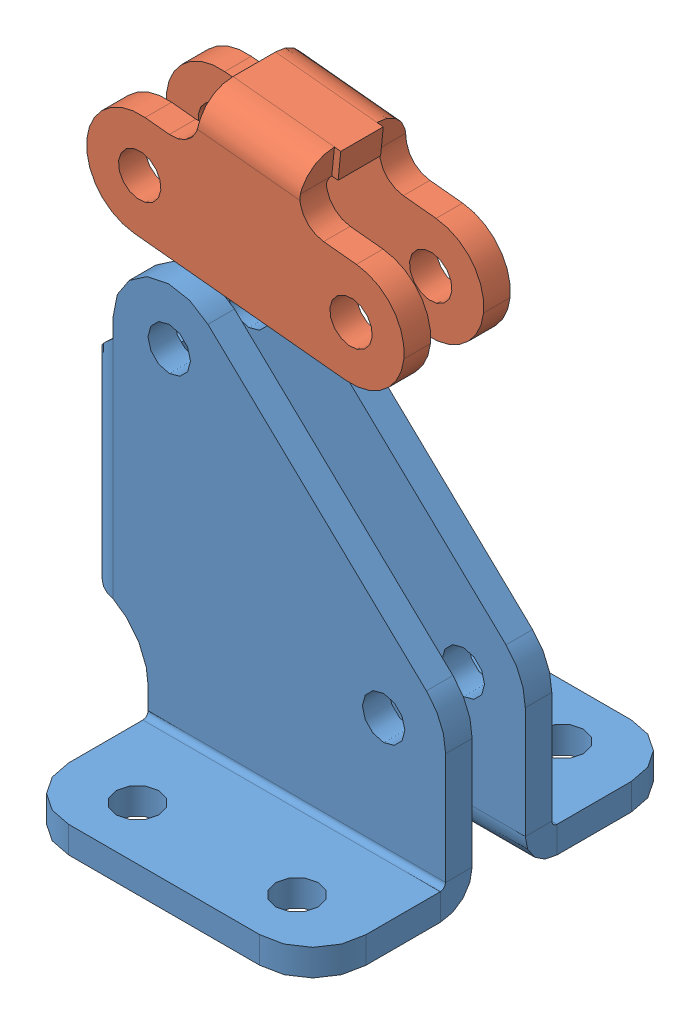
SolidWorks assembly collision.sldasm, configuration Default (file format 15000). Lengths in mm.
Overall size (151.57 125.24 44.45).
11 component instances, 7 part files, 10 mates.
Components (placement in the parent):
- base-2: base.SLDPRT [Default] at origin size (42.93 49.25 44.45)
- link-2: link.SLDPRT [Default] at (6.3491 58.7362 0) x (0.99488 -0.101064 0) z (0 0 1) size (38.1 19.05 12.7)
- hold-down sub-assy-1: hold-down sub-assy.SLDASM [Default] at (9.5597 31.1019 -6.35) x (0.847327 0.531072 0) z (0 0 1) size (96.01 63.5 19.3)
  - arm-1: arm.SLDPRT [Default] at origin size (96.01 23.62 15.88)
  - washer-1: washer.SLDPRT [Default] at (73.787 -2.286 0) x (0 0 -1) z (1 0 0) size (18.8 3.81 22.23)
  - washer-2: washer.SLDPRT [Default] at (73.787 18.161 0) x (0 0 -1) z (-1 0 0) size (18.8 3.81 22.23)
  - hold-down bolt-1: hold-down bolt.sldprt [Default] at (73.787 -32.766 0) size (19.3 63.5 19.3)
- handle sub-assy-1: handle sub-assy.sldasm [Default] at (13.8492 -2.9413 -12.7) x (0.574188 -0.818723 0) z (0 0 1) size (132.59 16.51 25.4)
  - handle-half-1: handle-half.SLDPRT [Default] at (2.3468 22.924 12.7) size (130.68 12.7 12.7)
  - handle-half-2: handle-half.SLDPRT [Default] at (2.3468 35.624 0) x (1 0 0) z (0 0 -1) size (130.68 12.7 12.7)
  - sleeve-1: sleeve.sldprt [Default] at (-128.3362 22.924 3.175) size (52.77 16.51 10.16)
Mates (geometry in assembly coordinates):
- MateCoincident15: coincident aligned: plane of base-2 through (0 50.8 0) normal (0 0 1); plane of assembly through (0 0 0) normal (0 0 1)
- MateCoincident16: coincident anti-aligned: plane of base-2 through (0 0 -12.7) normal (0 -1 0); plane of assembly through (0 0 0) normal (0 1 0)
- MateCoincident17: coincident anti-aligned: plane of base-2 through (0 50.8 -12.7) normal (-1 0 0); plane of assembly through (0 0 0) normal (1 0 0)
- MateConcentric10: concentric aligned: cylinder of base-2 through (35.5179 17.145 -28.575) axis (0 0 1) radius 2.54; cylinder of handle sub-assy-1/handle-half-1 through (35.5179 17.145 -6.35) axis (0 0 1) radius 2.54
- MateCoincident20: coincident anti-aligned: plane of base-2 through (0 50.8 0) normal (0 0 1); plane of handle sub-assy-1/handle-half-1 through (44.3629 15.5922 0) normal (0 0 -1)
- MateConcentric11: concentric aligned: cylinder of handle sub-assy-1/handle-half-1 through (6.3491 58.7362 -6.35) axis (0 0 1) radius 2.54; cylinder of link-2 through (6.3491 58.7362 -12.7) axis (0 0 1) radius 2.54
- MateCoincident21: coincident anti-aligned: plane of handle sub-assy-1/handle-half-1 through (14.9024 57.5993 0) normal (0 0 -1); plane of link-2 through (-0.6101 53.0604 0) normal (0 0 1)
- Concentric1: concentric aligned: cylinder of base-2 through (9.8818 42.545 -28.575) axis (0 0 1) radius 2.54; cylinder of hold-down sub-assy-1/arm-1 through (9.8818 42.545 -14.2875) axis (0 0 1) radius 2.54
- Coincident1: coincident anti-aligned: plane of base-2 through (42.926 50.8 -3.175) normal (0 0 -1); plane of hold-down sub-assy-1/arm-1 through (7.765 29.9771 -3.175) normal (0 0 1)
- Concentric2: concentric aligned: cylinder of hold-down sub-assy-1/arm-1 through (31.6191 56.1691 -14.2875) axis (0 0 1) radius 2.54; cylinder of link-2 through (31.6191 56.1691 -12.7) axis (0 0 1) radius 2.54
